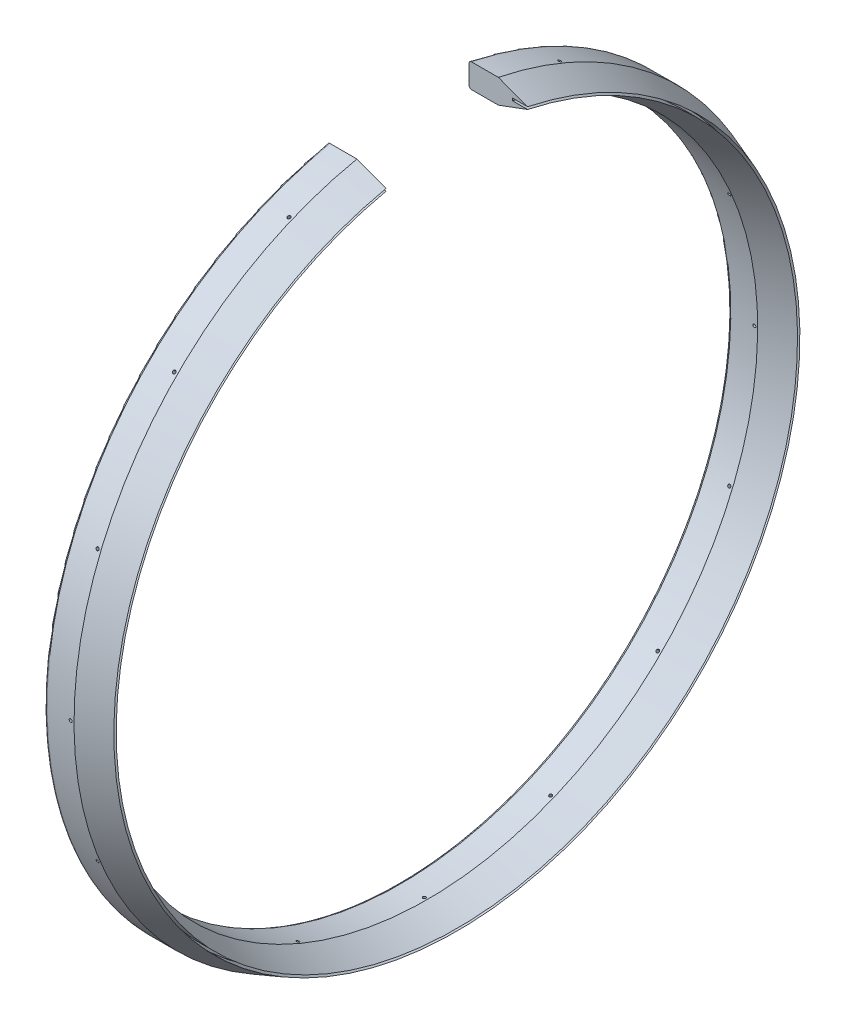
from build123d import *

# Parameters (mm, degrees)
SKETCH3_W          = 50
SKETCH3_H          = 60
CUT_EXTRUDE2_DEPTH = 177.8
CIRPATTERN2_COUNT  = 16
SKETCH5_R          = 0.635
CUT_EXTRUDE3_DEPTH = 175
CIRPATTERN3_COUNT  = 16
FILLET1_R          = 1


with BuildPart() as part:
    # Sketch1 → Revolve1 (revolve)
    with BuildSketch(Plane.XY, mode=Mode.PRIVATE) as revolve1_sk:
        Polygon((-12.4, 140), (-12.4, 150), (0, 150), (12.4, 145.5), (6, 145.5), (6, 144.5), (12.4, 144.5), (0, 140), align=None)
    revolve(revolve1_sk.sketch.rotate(Axis((-102.621263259, 0, 0), (1, 0, 0)), 90), axis=Axis((-102.621263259, 0, 0), (1, 0, 0)))

    # Sketch3 → Cut-Extrude2 (cut)
    with BuildSketch(Plane(origin=(0, 0, 0), x_dir=(1, 0, 0), z_dir=(0, 1, 0))):
        Rectangle(SKETCH3_W, SKETCH3_H)
    extrude(amount=CUT_EXTRUDE2_DEPTH, mode=Mode.SUBTRACT)

    # Sketch4 → M5x0.8 Tapped Hole1 (revolve, cut)
    with BuildSketch(Plane(origin=(-12.4, 0, -145), x_dir=(0, 0, 1), z_dir=(0, 1, 0))):
        Polygon((0, 0), (0, 11.6618073), (2.1, 10.4), (2.1, 0), align=None)
    m5x0_8_tapped_hole1 = revolve(axis=Axis((-18.75, 0, -145), (1, 0, 0)), mode=Mode.SUBTRACT)

    # CirPattern2: M5x0.8 Tapped Hole1 ×16 about axis
    cirpattern2_axis = Axis((0, 0, 0), (1, 0, 0))
    for i in range(1, CIRPATTERN2_COUNT):
        add(m5x0_8_tapped_hole1.rotate(cirpattern2_axis, i * 360 / CIRPATTERN2_COUNT), mode=Mode.SUBTRACT)

    # Sketch5 → Cut-Extrude3 (cut)
    with BuildSketch(Plane(origin=(0, 0, 0), x_dir=(1, 0, 0), z_dir=(0, 1, 0))):
        with Locations(Location((-1.4, 0, 0), (0, 0, 270))):
            Circle(SKETCH5_R)
    cut_extrude3 = extrude(amount=-CUT_EXTRUDE3_DEPTH, mode=Mode.SUBTRACT)

    # CirPattern3: Cut-Extrude3 ×16 about axis
    cirpattern3_axis = Axis((-12.4, 0, 0), (-1, 0, 0))
    for i in range(1, CIRPATTERN3_COUNT):
        add(cut_extrude3.rotate(cirpattern3_axis, i * 360 / CIRPATTERN3_COUNT), mode=Mode.SUBTRACT)

    # Fillet1
    fillet1_edges = [part.edges().sort_by_distance(p)[0] for p in [
        (-12.4, -140, 0),
        (-12.4, -150, 0),
    ]]
    fillet(fillet1_edges, radius=FILLET1_R)


solid = part.part
